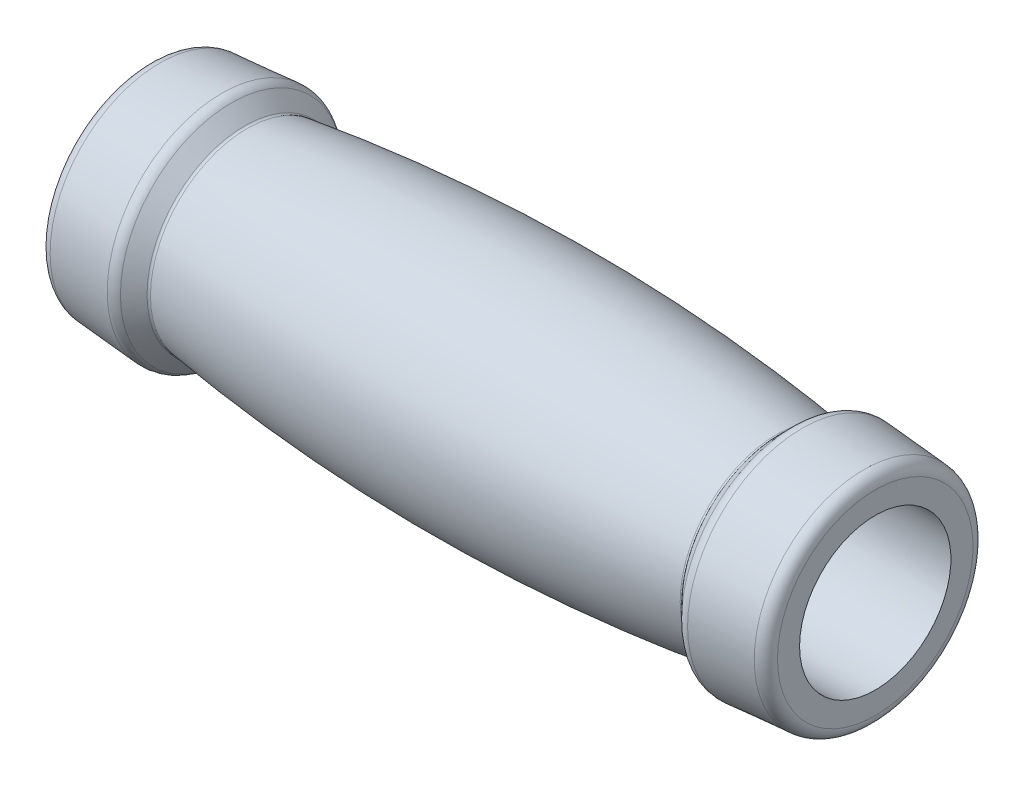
from build123d import *


with BuildPart() as part:
    # Esquisse1 → R_volution1 (revolve)
    with BuildSketch(Plane.XY, mode=Mode.PRIVATE) as r_volution1_sk:
        with BuildLine():
            Line((-60, 12.5), (60, 12.5))
            Line((60, 12.5), (60, 16.147937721))
            ThreePointArc((60, 16.147937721), (59.467444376, 17.506836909), (58.153392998, 18.142046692))
            Line((58.153392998, 18.142046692), (47.929868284, 18.92847167))
            ThreePointArc((47.929868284, 18.92847167), (47.072749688, 18.80646587), (46.347498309, 18.333657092))
            Line((46.347498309, 18.333657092), (44.176495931, 16.116602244))
            ThreePointArc((44.176495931, 16.116602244), (43.980718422, 15.993215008), (43.750352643, 15.971195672))
            ThreePointArc((43.750352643, 15.971195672), (0, 19), (-43.750352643, 15.971195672))
            ThreePointArc((-43.750352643, 15.971195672), (-43.980718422, 15.993215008), (-44.176495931, 16.116602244))
            Line((-44.176495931, 16.116602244), (-46.347498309, 18.333657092))
            ThreePointArc((-46.347498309, 18.333657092), (-47.072749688, 18.80646587), (-47.929868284, 18.92847167))
            Line((-47.929868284, 18.92847167), (-58.153392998, 18.142046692))
            ThreePointArc((-58.153392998, 18.142046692), (-59.467444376, 17.506836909), (-60, 16.147937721))
            Line((-60, 16.147937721), (-60, 12.5))
        make_face()
    revolve(r_volution1_sk.sketch.rotate(Axis((0, 0, 0), (1, 0, 0)), 90), axis=Axis((0, 0, 0), (1, 0, 0)))


solid = part.part
